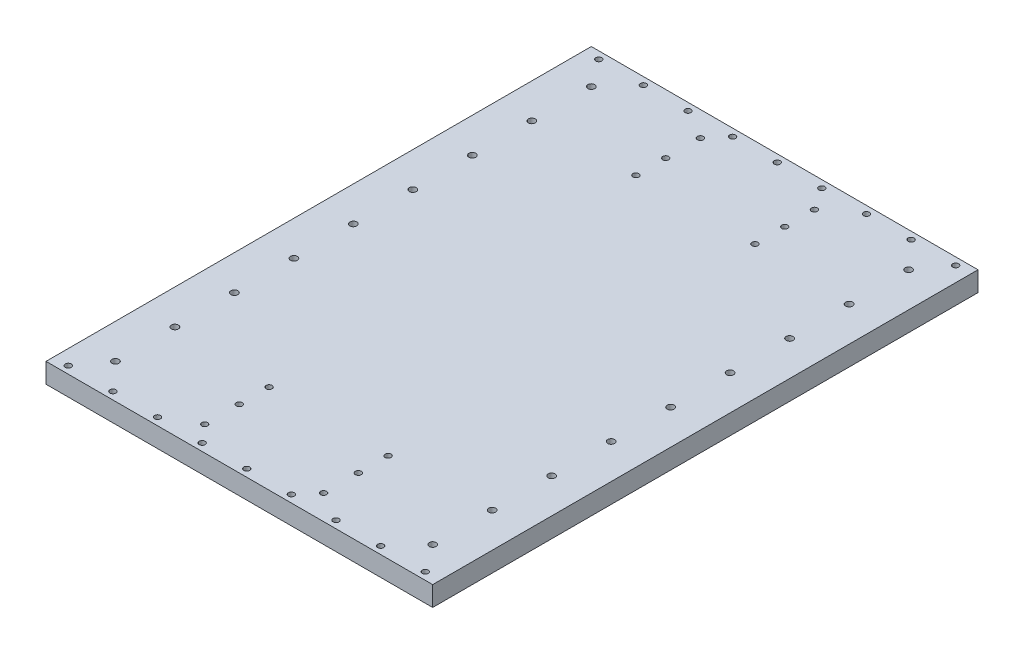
from build123d import *

# Parameters (mm, degrees)
BOSS_EXTRU_1_DEPTH      = 10
BOSS_EXTRU_1_DEPTH_BACK = 10
ESQUISSE1_W             = 390
ESQUISSE1_H             = 550
ESQUISSE1_R             = 3.5
ESQUISSE1_R_2           = 3


with BuildPart() as part:
    # Esquisse1 → Boss.-Extru.1 (new, two sides: drawn at the far end of the back side and taken through both)
    with BuildSketch(Plane(origin=(0, 0, 0), x_dir=(1, 0, 0), z_dir=(0, 1, 0)).offset(-BOSS_EXTRU_1_DEPTH_BACK)):
        Rectangle(ESQUISSE1_W, ESQUISSE1_H)
        with Locations(Location((160, 0, 0), (0, 0, 270))):
            Circle(ESQUISSE1_R, mode=Mode.SUBTRACT)
        with Locations(Location((160, 240, 0), (0, 0, 270))):
            Circle(ESQUISSE1_R, mode=Mode.SUBTRACT)
        with Locations(Location((160, 180, 0), (0, 0, 270))):
            Circle(ESQUISSE1_R, mode=Mode.SUBTRACT)
        with Locations(Location((160, 120, 0), (0, 0, 270))):
            Circle(ESQUISSE1_R, mode=Mode.SUBTRACT)
        with Locations(Location((160, 60, 0), (0, 0, 270))):
            Circle(ESQUISSE1_R, mode=Mode.SUBTRACT)
        with Locations(Location((160, -60, 0), (0, 0, 270))):
            Circle(ESQUISSE1_R, mode=Mode.SUBTRACT)
        with Locations(Location((160, -120, 0), (0, 0, 270))):
            Circle(ESQUISSE1_R, mode=Mode.SUBTRACT)
        with Locations(Location((160, -180, 0), (0, 0, 270))):
            Circle(ESQUISSE1_R, mode=Mode.SUBTRACT)
        with Locations(Location((160, -240, 0), (0, 0, 270))):
            Circle(ESQUISSE1_R, mode=Mode.SUBTRACT)
        with Locations(Location((-160, 240, 0), (0, 0, 270))):
            Circle(ESQUISSE1_R, mode=Mode.SUBTRACT)
        with Locations(Location((-160, 180, 0), (0, 0, 270))):
            Circle(ESQUISSE1_R, mode=Mode.SUBTRACT)
        with Locations(Location((-160, 120, 0), (0, 0, 270))):
            Circle(ESQUISSE1_R, mode=Mode.SUBTRACT)
        with Locations(Location((-160, 60, 0), (0, 0, 270))):
            Circle(ESQUISSE1_R, mode=Mode.SUBTRACT)
        with Locations(Location((-160, 0, 0), (0, 0, 270))):
            Circle(ESQUISSE1_R, mode=Mode.SUBTRACT)
        with Locations(Location((-160, -60, 0), (0, 0, 270))):
            Circle(ESQUISSE1_R, mode=Mode.SUBTRACT)
        with Locations(Location((-160, -120, 0), (0, 0, 270))):
            Circle(ESQUISSE1_R, mode=Mode.SUBTRACT)
        with Locations(Location((-160, -180, 0), (0, 0, 270))):
            Circle(ESQUISSE1_R, mode=Mode.SUBTRACT)
        with Locations(Location((-160, -240, 0), (0, 0, 270))):
            Circle(ESQUISSE1_R, mode=Mode.SUBTRACT)
        with Locations(Location((-180, -267.5, 0), (0, 0, 270))):
            Circle(ESQUISSE1_R_2, mode=Mode.SUBTRACT)
        with Locations(Location((-135, -267.5, 0), (0, 0, 270))):
            Circle(ESQUISSE1_R_2, mode=Mode.SUBTRACT)
        with Locations(Location((-90, -267.5, 0), (0, 0, 270))):
            Circle(ESQUISSE1_R_2, mode=Mode.SUBTRACT)
        with Locations(Location((-45, -267.5, 0), (0, 0, 270))):
            Circle(ESQUISSE1_R_2, mode=Mode.SUBTRACT)
        with Locations(Location((0, -267.5, 0), (0, 0, 270))):
            Circle(ESQUISSE1_R_2, mode=Mode.SUBTRACT)
        with Locations(Location((45, -267.5, 0), (0, 0, 270))):
            Circle(ESQUISSE1_R_2, mode=Mode.SUBTRACT)
        with Locations(Location((90, -267.5, 0), (0, 0, 270))):
            Circle(ESQUISSE1_R_2, mode=Mode.SUBTRACT)
        with Locations(Location((135, -267.5, 0), (0, 0, 270))):
            Circle(ESQUISSE1_R_2, mode=Mode.SUBTRACT)
        with Locations(Location((180, -267.5, 0), (0, 0, 270))):
            Circle(ESQUISSE1_R_2, mode=Mode.SUBTRACT)
        with Locations(Location((0, 267.5, 0), (0, 0, 270))):
            Circle(ESQUISSE1_R_2, mode=Mode.SUBTRACT)
        with Locations(Location((-180, 267.5, 0), (0, 0, 270))):
            Circle(ESQUISSE1_R_2, mode=Mode.SUBTRACT)
        with Locations(Location((-135, 267.5, 0), (0, 0, 270))):
            Circle(ESQUISSE1_R_2, mode=Mode.SUBTRACT)
        with Locations(Location((-90, 267.5, 0), (0, 0, 270))):
            Circle(ESQUISSE1_R_2, mode=Mode.SUBTRACT)
        with Locations(Location((-45, 267.5, 0), (0, 0, 270))):
            Circle(ESQUISSE1_R_2, mode=Mode.SUBTRACT)
        with Locations(Location((45, 267.5, 0), (0, 0, 270))):
            Circle(ESQUISSE1_R_2, mode=Mode.SUBTRACT)
        with Locations(Location((90, 267.5, 0), (0, 0, 270))):
            Circle(ESQUISSE1_R_2, mode=Mode.SUBTRACT)
        with Locations(Location((135, 267.5, 0), (0, 0, 270))):
            Circle(ESQUISSE1_R_2, mode=Mode.SUBTRACT)
        with Locations(Location((180, 267.5, 0), (0, 0, 270))):
            Circle(ESQUISSE1_R_2, mode=Mode.SUBTRACT)
        with Locations(Location((-60, 250, 0), (0, 0, 270))):
            Circle(ESQUISSE1_R_2, mode=Mode.SUBTRACT)
        with Locations(Location((-60, 215, 0), (0, 0, 270))):
            Circle(ESQUISSE1_R_2, mode=Mode.SUBTRACT)
        with Locations(Location((-60, 185, 0), (0, 0, 270))):
            Circle(ESQUISSE1_R_2, mode=Mode.SUBTRACT)
        with Locations(Location((-60, -250, 0), (0, 0, 270))):
            Circle(ESQUISSE1_R_2, mode=Mode.SUBTRACT)
        with Locations(Location((-60, -215, 0), (0, 0, 270))):
            Circle(ESQUISSE1_R_2, mode=Mode.SUBTRACT)
        with Locations(Location((-60, -185, 0), (0, 0, 270))):
            Circle(ESQUISSE1_R_2, mode=Mode.SUBTRACT)
        with Locations(Location((60, -185, 0), (0, 0, 270))):
            Circle(ESQUISSE1_R_2, mode=Mode.SUBTRACT)
        with Locations(Location((60, -215, 0), (0, 0, 270))):
            Circle(ESQUISSE1_R_2, mode=Mode.SUBTRACT)
        with Locations(Location((60, -250, 0), (0, 0, 270))):
            Circle(ESQUISSE1_R_2, mode=Mode.SUBTRACT)
        with Locations(Location((60, 245, 0), (0, 0, 270))):
            Circle(ESQUISSE1_R_2, mode=Mode.SUBTRACT)
        with Locations(Location((60, 215, 0), (0, 0, 270))):
            Circle(ESQUISSE1_R_2, mode=Mode.SUBTRACT)
        with Locations(Location((60, 185, 0), (0, 0, 270))):
            Circle(ESQUISSE1_R_2, mode=Mode.SUBTRACT)
    extrude(amount=BOSS_EXTRU_1_DEPTH + BOSS_EXTRU_1_DEPTH_BACK)


solid = part.part
